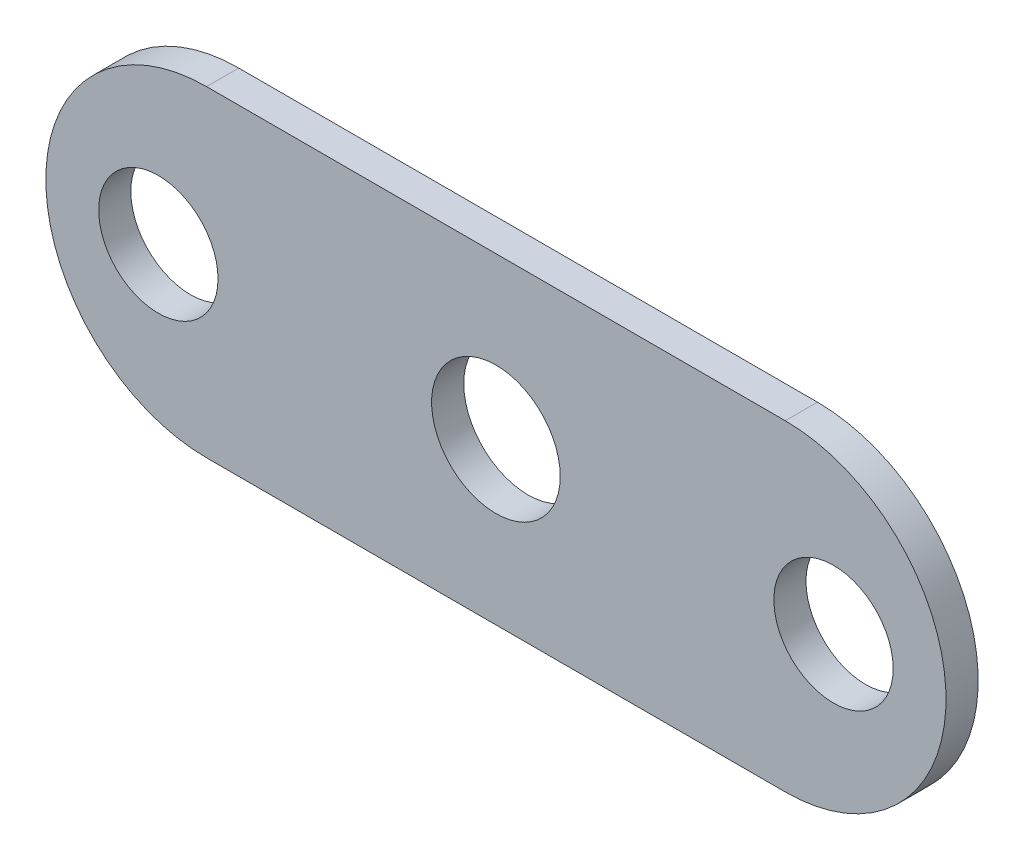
ISO-10303-21;
HEADER;
FILE_DESCRIPTION(('STEP AP214'),'2;1');
FILE_NAME('part.step','',(''),(''),'','','');
FILE_SCHEMA(('AUTOMOTIVE_DESIGN { 1 0 10303 214 1 1 1 1 }'));
ENDSEC;
DATA;
#1=APPLICATION_CONTEXT('core data for automotive mechanical design processes');
#2=APPLICATION_PROTOCOL_DEFINITION('international standard','automotive_design',2000,#1);
#3=PRODUCT_CONTEXT('',#1,'mechanical');
#4=PRODUCT('Part','Part','',(#3));
#5=PRODUCT_RELATED_PRODUCT_CATEGORY('part','',(#4));
#6=PRODUCT_DEFINITION_FORMATION('','',#4);
#7=PRODUCT_DEFINITION_CONTEXT('part definition',#1,'design');
#8=PRODUCT_DEFINITION('design','',#6,#7);
#9=PRODUCT_DEFINITION_SHAPE('','',#8);
#10=(LENGTH_UNIT() NAMED_UNIT(*) SI_UNIT(.MILLI.,.METRE.));
#11=(NAMED_UNIT(*) PLANE_ANGLE_UNIT() SI_UNIT($,.RADIAN.));
#12=(NAMED_UNIT(*) SI_UNIT($,.STERADIAN.) SOLID_ANGLE_UNIT());
#13=UNCERTAINTY_MEASURE_WITH_UNIT(LENGTH_MEASURE(1.E-05),#10,'distance_accuracy_value','');
#14=(GEOMETRIC_REPRESENTATION_CONTEXT(3) GLOBAL_UNCERTAINTY_ASSIGNED_CONTEXT((#13)) GLOBAL_UNIT_ASSIGNED_CONTEXT((#10,
#11,#12)) REPRESENTATION_CONTEXT('',''));
#15=CARTESIAN_POINT('',(0.,0.,0.));
#16=DIRECTION('',(0.,0.,1.));
#17=DIRECTION('',(1.,0.,0.));
#18=AXIS2_PLACEMENT_3D('',#15,#16,#17);
#19=CARTESIAN_POINT('',(-7.14375,0.,0.79375));
#20=DIRECTION('',(0.,0.,-1.));
#21=DIRECTION('',(-1.,0.,0.));
#22=AXIS2_PLACEMENT_3D('',#19,#20,#21);
#23=CYLINDRICAL_SURFACE('',#22,3.96875);
#24=CARTESIAN_POINT('',(-7.14375,0.,0.));
#25=DIRECTION('',(0.,0.,1.));
#26=DIRECTION('',(-1.,0.,0.));
#27=AXIS2_PLACEMENT_3D('',#24,#25,#26);
#28=CIRCLE('',#27,3.96875);
#29=CARTESIAN_POINT('',(-7.14375,3.96875,0.));
#30=VERTEX_POINT('',#29);
#31=CARTESIAN_POINT('',(-7.14375,-3.96875,0.));
#32=VERTEX_POINT('',#31);
#33=EDGE_CURVE('E79',#30,#32,#28,.T.);
#34=ORIENTED_EDGE('',*,*,#33,.T.);
#35=DIRECTION('',(0.,0.,-1.));
#36=VECTOR('',#35,1.);
#37=CARTESIAN_POINT('',(-7.14375,-3.96875,0.79375));
#38=LINE('',#37,#36);
#39=CARTESIAN_POINT('',(-7.14375,-3.96875,0.79375));
#40=VERTEX_POINT('',#39);
#41=EDGE_CURVE('E11',#40,#32,#38,.T.);
#42=ORIENTED_EDGE('',*,*,#41,.F.);
#43=CARTESIAN_POINT('',(-7.14375,0.,0.79375));
#44=DIRECTION('',(0.,0.,1.));
#45=DIRECTION('',(-1.,0.,0.));
#46=AXIS2_PLACEMENT_3D('',#43,#44,#45);
#47=CIRCLE('',#46,3.96875);
#48=CARTESIAN_POINT('',(-7.14375,3.96875,0.79375));
#49=VERTEX_POINT('',#48);
#50=EDGE_CURVE('E102',#49,#40,#47,.T.);
#51=ORIENTED_EDGE('',*,*,#50,.F.);
#52=DIRECTION('',(0.,0.,-1.));
#53=VECTOR('',#52,1.);
#54=CARTESIAN_POINT('',(-7.14375,3.96875,0.79375));
#55=LINE('',#54,#53);
#56=EDGE_CURVE('E91',#49,#30,#55,.T.);
#57=ORIENTED_EDGE('',*,*,#56,.T.);
#58=EDGE_LOOP('',(#34,#42,#51,#57));
#59=FACE_BOUND('',#58,.T.);
#60=ADVANCED_FACE('F33',(#59),#23,.T.);
#61=CARTESIAN_POINT('',(-7.14375,-3.96875,0.79375));
#62=DIRECTION('',(0.,1.,0.));
#63=DIRECTION('',(0.,0.,1.));
#64=AXIS2_PLACEMENT_3D('',#61,#62,#63);
#65=PLANE('',#64);
#66=DIRECTION('',(1.,0.,0.));
#67=VECTOR('',#66,1.);
#68=CARTESIAN_POINT('',(-7.14375,-3.96875,0.));
#69=LINE('',#68,#67);
#70=CARTESIAN_POINT('',(7.14375,-3.96875,0.));
#71=VERTEX_POINT('',#70);
#72=EDGE_CURVE('E75',#32,#71,#69,.T.);
#73=ORIENTED_EDGE('',*,*,#72,.T.);
#74=DIRECTION('',(0.,0.,-1.));
#75=VECTOR('',#74,1.);
#76=CARTESIAN_POINT('',(7.14375,-3.96875,0.79375));
#77=LINE('',#76,#75);
#78=CARTESIAN_POINT('',(7.14375,-3.96875,0.79375));
#79=VERTEX_POINT('',#78);
#80=EDGE_CURVE('E41',#79,#71,#77,.T.);
#81=ORIENTED_EDGE('',*,*,#80,.F.);
#82=DIRECTION('',(1.,0.,0.));
#83=VECTOR('',#82,1.);
#84=CARTESIAN_POINT('',(-7.14375,-3.96875,0.79375));
#85=LINE('',#84,#83);
#86=EDGE_CURVE('E87',#40,#79,#85,.T.);
#87=ORIENTED_EDGE('',*,*,#86,.F.);
#88=ORIENTED_EDGE('',*,*,#41,.T.);
#89=EDGE_LOOP('',(#73,#81,#87,#88));
#90=FACE_BOUND('',#89,.T.);
#91=ADVANCED_FACE('F86',(#90),#65,.F.);
#92=CARTESIAN_POINT('',(7.14375,0.,0.79375));
#93=DIRECTION('',(0.,0.,-1.));
#94=DIRECTION('',(-1.,0.,0.));
#95=AXIS2_PLACEMENT_3D('',#92,#93,#94);
#96=CYLINDRICAL_SURFACE('',#95,3.96875);
#97=CARTESIAN_POINT('',(7.14375,0.,0.));
#98=DIRECTION('',(0.,0.,1.));
#99=DIRECTION('',(1.,0.,0.));
#100=AXIS2_PLACEMENT_3D('',#97,#98,#99);
#101=CIRCLE('',#100,3.96875);
#102=CARTESIAN_POINT('',(7.14375,3.96875,0.));
#103=VERTEX_POINT('',#102);
#104=EDGE_CURVE('E80',#71,#103,#101,.T.);
#105=ORIENTED_EDGE('',*,*,#104,.T.);
#106=DIRECTION('',(0.,0.,-1.));
#107=VECTOR('',#106,1.);
#108=CARTESIAN_POINT('',(7.14375,3.96875,0.79375));
#109=LINE('',#108,#107);
#110=CARTESIAN_POINT('',(7.14375,3.96875,0.79375));
#111=VERTEX_POINT('',#110);
#112=EDGE_CURVE('E108',#111,#103,#109,.T.);
#113=ORIENTED_EDGE('',*,*,#112,.F.);
#114=CARTESIAN_POINT('',(7.14375,0.,0.79375));
#115=DIRECTION('',(0.,0.,1.));
#116=DIRECTION('',(1.,0.,0.));
#117=AXIS2_PLACEMENT_3D('',#114,#115,#116);
#118=CIRCLE('',#117,3.96875);
#119=EDGE_CURVE('E54',#79,#111,#118,.T.);
#120=ORIENTED_EDGE('',*,*,#119,.F.);
#121=ORIENTED_EDGE('',*,*,#80,.T.);
#122=EDGE_LOOP('',(#105,#113,#120,#121));
#123=FACE_BOUND('',#122,.T.);
#124=ADVANCED_FACE('F112',(#123),#96,.T.);
#125=CARTESIAN_POINT('',(-7.14375,3.96875,0.79375));
#126=DIRECTION('',(0.,-1.,0.));
#127=DIRECTION('',(0.,0.,-1.));
#128=AXIS2_PLACEMENT_3D('',#125,#126,#127);
#129=PLANE('',#128);
#130=DIRECTION('',(-1.,0.,0.));
#131=VECTOR('',#130,1.);
#132=CARTESIAN_POINT('',(-7.14375,3.96875,0.));
#133=LINE('',#132,#131);
#134=EDGE_CURVE('E100',#103,#30,#133,.T.);
#135=ORIENTED_EDGE('',*,*,#134,.T.);
#136=ORIENTED_EDGE('',*,*,#56,.F.);
#137=DIRECTION('',(-1.,0.,0.));
#138=VECTOR('',#137,1.);
#139=CARTESIAN_POINT('',(-7.14375,3.96875,0.79375));
#140=LINE('',#139,#138);
#141=EDGE_CURVE('E49',#111,#49,#140,.T.);
#142=ORIENTED_EDGE('',*,*,#141,.F.);
#143=ORIENTED_EDGE('',*,*,#112,.T.);
#144=EDGE_LOOP('',(#135,#136,#142,#143));
#145=FACE_BOUND('',#144,.T.);
#146=ADVANCED_FACE('F114',(#145),#129,.F.);
#147=CARTESIAN_POINT('',(-7.14375,0.,0.79375));
#148=DIRECTION('',(0.,0.,-1.));
#149=DIRECTION('',(-1.,0.,0.));
#150=AXIS2_PLACEMENT_3D('',#147,#148,#149);
#151=PLANE('',#150);
#152=CARTESIAN_POINT('',(0.,0.,0.79375));
#153=DIRECTION('',(0.,0.,1.));
#154=DIRECTION('',(1.,0.,0.));
#155=AXIS2_PLACEMENT_3D('',#152,#153,#154);
#156=CIRCLE('',#155,1.5875);
#157=CARTESIAN_POINT('',(1.5875,0.,0.79375));
#158=VERTEX_POINT('',#157);
#159=EDGE_CURVE('E194',#158,#158,#156,.T.);
#160=ORIENTED_EDGE('',*,*,#159,.F.);
#161=EDGE_LOOP('',(#160));
#162=FACE_BOUND('',#161,.T.);
#163=CARTESIAN_POINT('',(-8.334375,0.,0.793750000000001));
#164=DIRECTION('',(0.,0.,1.));
#165=DIRECTION('',(1.,0.,0.));
#166=AXIS2_PLACEMENT_3D('',#163,#164,#165);
#167=CIRCLE('',#166,1.4732);
#168=CARTESIAN_POINT('',(-6.861175,0.,0.793750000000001));
#169=VERTEX_POINT('',#168);
#170=EDGE_CURVE('E195',#169,#169,#167,.T.);
#171=ORIENTED_EDGE('',*,*,#170,.F.);
#172=EDGE_LOOP('',(#171));
#173=FACE_BOUND('',#172,.T.);
#174=CARTESIAN_POINT('',(8.334375,0.,0.793750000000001));
#175=DIRECTION('',(0.,0.,1.));
#176=DIRECTION('',(1.,0.,0.));
#177=AXIS2_PLACEMENT_3D('',#174,#175,#176);
#178=CIRCLE('',#177,1.4732);
#179=CARTESIAN_POINT('',(9.807575,0.,0.793750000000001));
#180=VERTEX_POINT('',#179);
#181=EDGE_CURVE('E95',#180,#180,#178,.T.);
#182=ORIENTED_EDGE('',*,*,#181,.F.);
#183=EDGE_LOOP('',(#182));
#184=FACE_BOUND('',#183,.T.);
#185=ORIENTED_EDGE('',*,*,#50,.T.);
#186=ORIENTED_EDGE('',*,*,#86,.T.);
#187=ORIENTED_EDGE('',*,*,#119,.T.);
#188=ORIENTED_EDGE('',*,*,#141,.T.);
#189=EDGE_LOOP('',(#185,#186,#187,#188));
#190=FACE_BOUND('',#189,.T.);
#191=ADVANCED_FACE('F115',(#162,#173,#184,#190),#151,.F.);
#192=CARTESIAN_POINT('',(-7.14375,0.,0.));
#193=DIRECTION('',(0.,0.,-1.));
#194=DIRECTION('',(-1.,0.,0.));
#195=AXIS2_PLACEMENT_3D('',#192,#193,#194);
#196=PLANE('',#195);
#197=CARTESIAN_POINT('',(0.,0.,0.));
#198=DIRECTION('',(0.,0.,-1.));
#199=DIRECTION('',(-1.,0.,0.));
#200=AXIS2_PLACEMENT_3D('',#197,#198,#199);
#201=CIRCLE('',#200,1.5875);
#202=CARTESIAN_POINT('',(-1.5875,0.,0.));
#203=VERTEX_POINT('',#202);
#204=EDGE_CURVE('E192',#203,#203,#201,.F.);
#205=ORIENTED_EDGE('',*,*,#204,.T.);
#206=EDGE_LOOP('',(#205));
#207=FACE_BOUND('',#206,.T.);
#208=CARTESIAN_POINT('',(-8.334375,0.,0.));
#209=DIRECTION('',(0.,0.,-1.));
#210=DIRECTION('',(-1.,0.,0.));
#211=AXIS2_PLACEMENT_3D('',#208,#209,#210);
#212=CIRCLE('',#211,1.4732);
#213=CARTESIAN_POINT('',(-9.80757499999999,0.,0.));
#214=VERTEX_POINT('',#213);
#215=EDGE_CURVE('E36',#214,#214,#212,.T.);
#216=ORIENTED_EDGE('',*,*,#215,.F.);
#217=EDGE_LOOP('',(#216));
#218=FACE_BOUND('',#217,.T.);
#219=CARTESIAN_POINT('',(8.334375,0.,0.));
#220=DIRECTION('',(0.,0.,-1.));
#221=DIRECTION('',(-1.,0.,0.));
#222=AXIS2_PLACEMENT_3D('',#219,#220,#221);
#223=CIRCLE('',#222,1.4732);
#224=CARTESIAN_POINT('',(6.861175,0.,0.));
#225=VERTEX_POINT('',#224);
#226=EDGE_CURVE('E92',#225,#225,#223,.T.);
#227=ORIENTED_EDGE('',*,*,#226,.F.);
#228=EDGE_LOOP('',(#227));
#229=FACE_BOUND('',#228,.T.);
#230=ORIENTED_EDGE('',*,*,#33,.F.);
#231=ORIENTED_EDGE('',*,*,#134,.F.);
#232=ORIENTED_EDGE('',*,*,#104,.F.);
#233=ORIENTED_EDGE('',*,*,#72,.F.);
#234=EDGE_LOOP('',(#230,#231,#232,#233));
#235=FACE_BOUND('',#234,.T.);
#236=ADVANCED_FACE('F76',(#207,#218,#229,#235),#196,.T.);
#237=CARTESIAN_POINT('',(8.334375,0.,0.79375));
#238=DIRECTION('',(0.,0.,1.));
#239=DIRECTION('',(1.,0.,0.));
#240=AXIS2_PLACEMENT_3D('',#237,#238,#239);
#241=CYLINDRICAL_SURFACE('',#240,1.4732);
#242=ORIENTED_EDGE('',*,*,#226,.T.);
#243=EDGE_LOOP('',(#242));
#244=FACE_BOUND('',#243,.T.);
#245=ORIENTED_EDGE('',*,*,#181,.T.);
#246=EDGE_LOOP('',(#245));
#247=FACE_BOUND('',#246,.T.);
#248=ADVANCED_FACE('F123',(#244,#247),#241,.F.);
#249=CARTESIAN_POINT('',(-8.334375,0.,0.79375));
#250=DIRECTION('',(0.,0.,1.));
#251=DIRECTION('',(1.,0.,0.));
#252=AXIS2_PLACEMENT_3D('',#249,#250,#251);
#253=CYLINDRICAL_SURFACE('',#252,1.4732);
#254=ORIENTED_EDGE('',*,*,#215,.T.);
#255=EDGE_LOOP('',(#254));
#256=FACE_BOUND('',#255,.T.);
#257=ORIENTED_EDGE('',*,*,#170,.T.);
#258=EDGE_LOOP('',(#257));
#259=FACE_BOUND('',#258,.T.);
#260=ADVANCED_FACE('F154',(#256,#259),#253,.F.);
#261=CARTESIAN_POINT('',(0.,0.,-0.00100000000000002));
#262=DIRECTION('',(0.,0.,1.));
#263=DIRECTION('',(1.,0.,0.));
#264=AXIS2_PLACEMENT_3D('',#261,#262,#263);
#265=CYLINDRICAL_SURFACE('',#264,1.5875);
#266=ORIENTED_EDGE('',*,*,#204,.F.);
#267=EDGE_LOOP('',(#266));
#268=FACE_BOUND('',#267,.T.);
#269=ORIENTED_EDGE('',*,*,#159,.T.);
#270=EDGE_LOOP('',(#269));
#271=FACE_BOUND('',#270,.T.);
#272=ADVANCED_FACE('F164',(#268,#271),#265,.F.);
#273=CLOSED_SHELL('',(#60,#91,#124,#146,#191,#236,#248,#260,#272));
#274=MANIFOLD_SOLID_BREP('B2',#273);
#275=ADVANCED_BREP_SHAPE_REPRESENTATION('',(#18,#274),#14);
#276=SHAPE_DEFINITION_REPRESENTATION(#9,#275);
ENDSEC;
END-ISO-10303-21;
